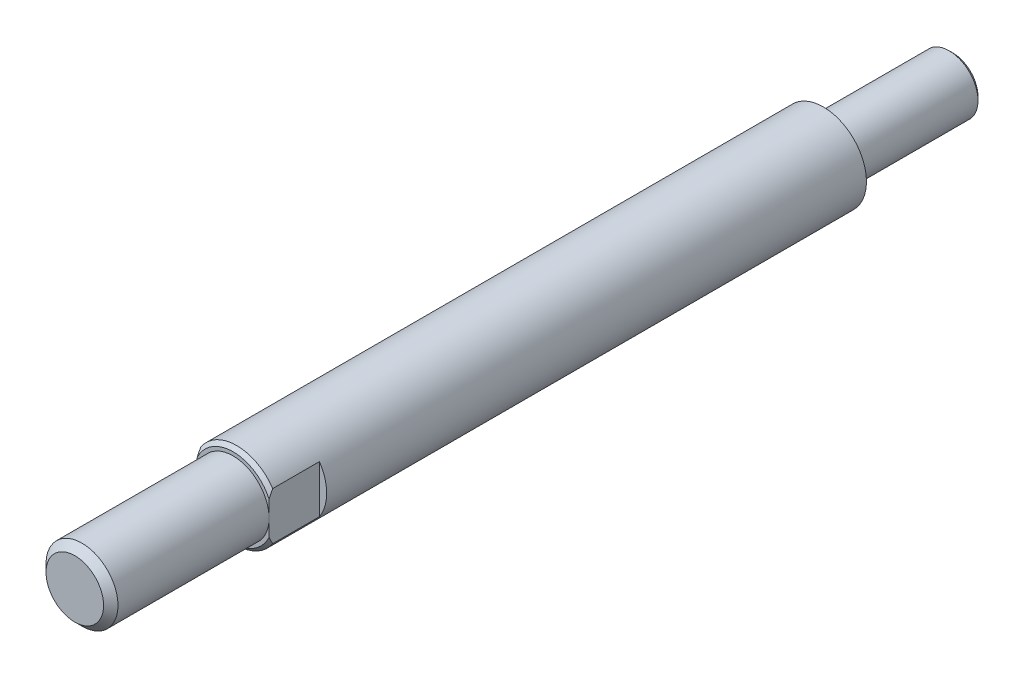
from build123d import *

# Parameters (mm, degrees)
ESQUISSE1_R                     = 6
EXTRUSION1_DEPTH                = 122
ESQUISSE2_OUTSIDE_W             = 38.634
ESQUISSE2_OUTSIDE_H             = 38.634
ESQUISSE2_OUTSIDE_R             = 5
ENL_V_MAT_EXTRU_1_DEPTH         = 22
ESQUISSE3_OUTSIDE_W             = 38.634
ESQUISSE3_OUTSIDE_H             = 38.634
ESQUISSE3_OUTSIDE_R             = 4
ENL_V_MAT_EXTRU_2_DEPTH         = 18
CHANFREIN1_SIZE                 = 1
CHANFREIN2_SIZE                 = 0.5
ESQUISSE4_W                     = 1
ESQUISSE4_H                     = 7
ENL_V_MAT_EXTRU_3_DEPTH         = 123.29472597
TROU_TARAUD_M6X1_01_D           = 5
TROU_TARAUD_M6X1_01_DEPTH       = 20
TROU_TARAUD_M6X1_01_CSINK_D     = 6
TROU_TARAUD_M6X1_01_CSINK_ANGLE = 90
TROU_TARAUD_M6X1_01_TIP         = 1.502151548


with BuildPart() as part:
    # Esquisse1 → Extrusion1 (new body)
    with BuildSketch(Plane.XY):
        with Locations(Location((0, 0, 0), (0, 0, 180))):
            Circle(ESQUISSE1_R)
    extrude(amount=EXTRUSION1_DEPTH)

    # Esquisse2 outside → Enl_v. mat.-Extru.1 (cut)
    with BuildSketch(Plane.XY.offset(122)):
        Rectangle(ESQUISSE2_OUTSIDE_W, ESQUISSE2_OUTSIDE_H)
        Circle(ESQUISSE2_OUTSIDE_R, mode=Mode.SUBTRACT)
    extrude(amount=-ENL_V_MAT_EXTRU_1_DEPTH, mode=Mode.SUBTRACT)

    # Esquisse3 outside → Enl_v. mat.-Extru.2 (cut)
    with BuildSketch(Plane(origin=(0, 0, 0), x_dir=(-1, 0, 0), z_dir=(0, 0, -1))):
        Rectangle(ESQUISSE3_OUTSIDE_W, ESQUISSE3_OUTSIDE_H)
        Circle(ESQUISSE3_OUTSIDE_R, mode=Mode.SUBTRACT)
    extrude(amount=-ENL_V_MAT_EXTRU_2_DEPTH, mode=Mode.SUBTRACT)

    # Chanfrein1
    chanfrein1_edges = [part.edges().sort_by_distance(p)[0] for p in [
        (-5, 0, 122),
    ]]
    chamfer(chanfrein1_edges, length=CHANFREIN1_SIZE)

    # Chanfrein2
    chanfrein2_edges = [part.edges().sort_by_distance(p)[0] for p in [
        (4, 0, 0),
        (6, 0, 100),
    ]]
    chamfer(chanfrein2_edges, length=CHANFREIN2_SIZE)

    # Esquisse4 → Enl_v. mat.-Extru.3 (cut, symmetric)
    with BuildSketch(Plane(origin=(0, 0, 0), x_dir=(1, 0, 0), z_dir=(0, 1, 0))):
        with Locations((5.5, -96.5)):
            Rectangle(ESQUISSE4_W, ESQUISSE4_H)
    enl_v_mat_extru_3 = extrude(amount=ENL_V_MAT_EXTRU_3_DEPTH, both=True, mode=Mode.SUBTRACT)

    # Sym_trie1: Enl_v. mat.-Extru.3 across plane
    add(enl_v_mat_extru_3.mirror(Plane(origin=(0, 0, 0), x_dir=(0, 0, 1), z_dir=(1, 0, 0))), mode=Mode.SUBTRACT)

    # Trou taraud_ M6x1.01
    with Locations(Plane(origin=(0, 0, 0), x_dir=(-1, 0, 0), z_dir=(0, 0, -1))):
        with Locations((0, 0)):
            CounterSinkHole(TROU_TARAUD_M6X1_01_D / 2, TROU_TARAUD_M6X1_01_CSINK_D / 2, depth=TROU_TARAUD_M6X1_01_DEPTH, counter_sink_angle=TROU_TARAUD_M6X1_01_CSINK_ANGLE)
            with Locations((0, 0, -(TROU_TARAUD_M6X1_01_DEPTH + TROU_TARAUD_M6X1_01_TIP / 2))):  # 118° drill point
                Cone(0, TROU_TARAUD_M6X1_01_D / 2, TROU_TARAUD_M6X1_01_TIP, mode=Mode.SUBTRACT)


solid = part.part
